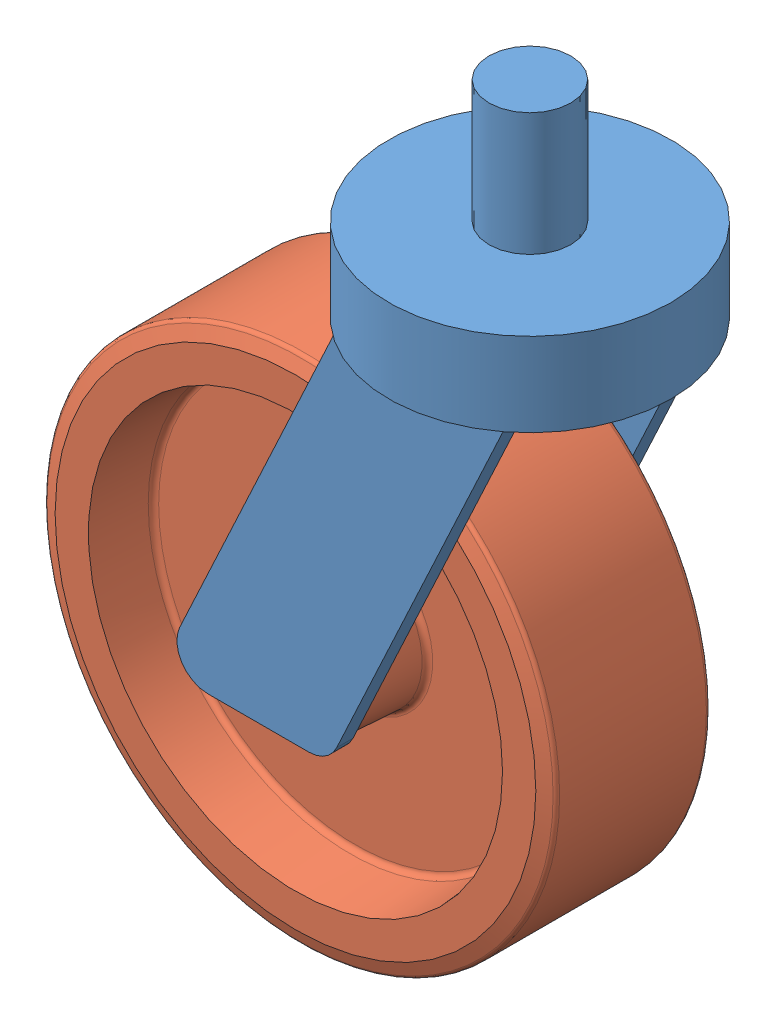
SolidWorks assembly castor.SLDASM, configuration Default (file format 15000). Lengths in mm.
Overall size (268.59 384.8 138).
2 component instances, 2 part files, 2 mates.
Components (placement in the parent):
- castor_staff-1: castor_staff.SLDPRT [Default] at (12.2431 37.502 294) size (187.56 284.8 138)
- castor_wheel-1: castor_wheel.SLDPRT [Default] at (-62.3469 -112.498 294) x (0 0 1) z (-1 0 0) size (86 250 250)
Mates (geometry in assembly coordinates):
- Concentrico1: concentric anti-aligned: cylinder of castor_staff-1 through (-62.3469 -112.498 222.5442) axis (0 0 1) radius 9; cylinder of castor_wheel-1 through (-62.3469 -112.498 -175.6749) axis (0 0 -1) radius 9
- Larghezza1: width aligned: plane of castor_staff-1 through (-41.8147 -122.498 340) normal (0 0 -1); plane of castor_staff-1 through (-41.8147 -122.498 248) normal (0 0 1); plane of castor_wheel-1 through (-62.3469 -103.498 251) normal (0 0 -1); plane of castor_wheel-1 through (-62.3469 -103.498 337) normal (0 0 1)
